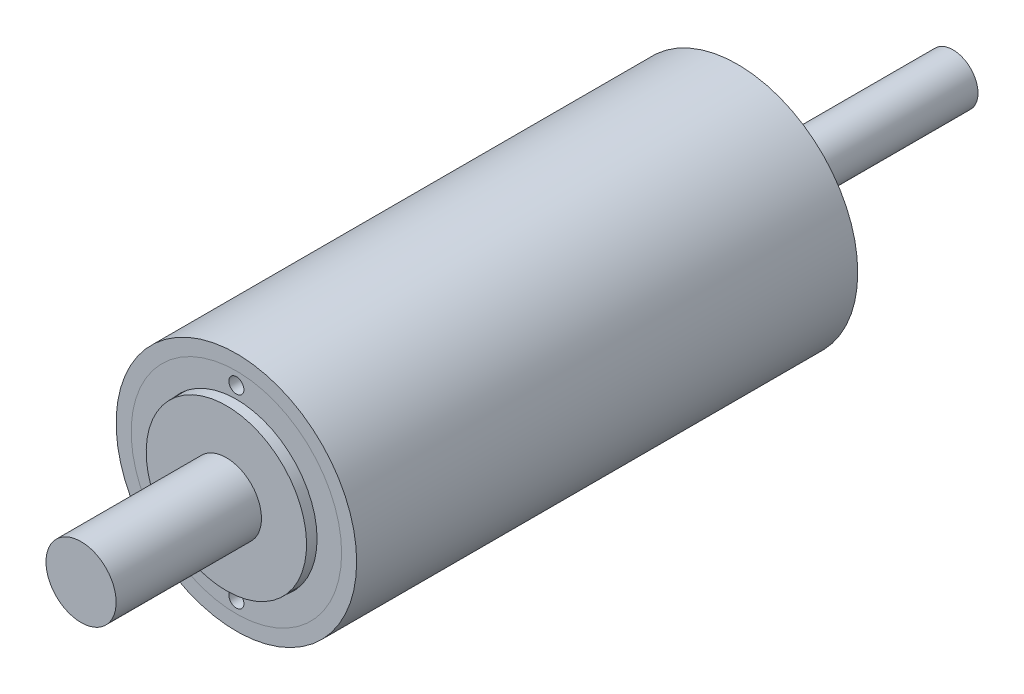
from build123d import *

# Parameters (mm, degrees)
SKETCH5_R            = 20
SKETCH5_R_2          = 8.5
BOSS_EXTRUDE1_DEPTH  = 12
SKETCH6_R            = 20
SKETCH6_R_2          = 8.5
BOSS_EXTRUDE2_DEPTH  = 12
SKETCH7_R            = 11.5
SKETCH7_R_2          = 8.5
BOSS_EXTRUDE3_DEPTH  = 2
BOSS_EXTRUDE4_START  = 8
SKETCH8_R            = 17.5
SKETCH8_R_2          = 8.5
BOSS_EXTRUDE4_DEPTH  = 8
SKETCH9_R            = 16
SKETCH9_R_2          = 6
BOSS_EXTRUDE5_DEPTH  = 10
SKETCH11_R           = 15.5
SKETCH11_R_2         = 14
BOSS_EXTRUDE8_DEPTH  = 10
SKETCH12_R           = 16
SKETCH12_R_2         = 6
BOSS_EXTRUDE9_DEPTH  = 10
SKETCH13_R           = 9
SKETCH13_R_2         = 6
BOSS_EXTRUDE10_DEPTH = 2
BOSS_EXTRUDE11_START = 8
SKETCH14_R           = 13
SKETCH14_R_2         = 6
BOSS_EXTRUDE11_DEPTH = 8
SKETCH15_R           = 24
BOSS_EXTRUDE12_DEPTH = 50
SKETCH16_R           = 16
CUT_EXTRUDE1_DEPTH   = 100
SKETCH17_R           = 21
SKETCH17_R_2         = 16
CUT_EXTRUDE2_DEPTH   = 11
CUT_EXTRUDE3_START   = -34
SKETCH18_R           = 20
SKETCH18_R_2         = 16
CUT_EXTRUDE3_DEPTH   = 34
CUT_EXTRUDE4_START   = -14
SKETCH19_R           = 18
SKETCH19_R_2         = 16
CUT_EXTRUDE4_DEPTH   = 14
SKETCH20_R           = 21
SKETCH20_R_2         = 20
CUT_EXTRUDE5_DEPTH   = 10
SKETCH21_R           = 21
SKETCH21_R_2         = 16.1
BOSS_EXTRUDE13_DEPTH = 10
SKETCH22_R           = 1.5
CUT_EXTRUDE6_DEPTH   = 5
SKETCH23_R           = 21
SKETCH23_R_2         = 13.5
BOSS_EXTRUDE14_DEPTH = 10
SKETCH24_R           = 1.5
CUT_EXTRUDE7_DEPTH   = 5


with BuildPart() as part:
    # Sketch1 → Revolve2 (revolve)
    with BuildSketch(Plane(origin=(0, 0, 0), x_dir=(0, 0, -1), z_dir=(1, 0, 0)), mode=Mode.PRIVATE) as revolve2_sk:
        Polygon((-81, 0), (-81, 7), (-52, 7), (-52, 16), (-48, 16), (-48, 7.4), (-44, 7.4), (-44, 11), (-40, 11), (-40, 8.5), (-16, 8.5), (-16, 7.5), (-14, 7.5), (-14, 8.45), (-1, 8.45), (-1, 7.4), (9, 7.4), (9, 6), (39, 6), (39, 5), (41, 5), (41, 5.95), (53, 5.95), (53, 5), (93, 5), (93, 0), align=None)
    revolve(revolve2_sk.sketch.rotate(Axis((0, 0, 126.394277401), (0, 0, -1)), 180), axis=Axis((0, 0, 126.394277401), (0, 0, -1)))


with BuildPart() as body_2:
    # Sketch5 → Boss-Extrude1 (new body)
    with BuildSketch(Plane(origin=(0, 0, 40), x_dir=(-1, 0, 0), z_dir=(0, 0, -1))):
        with Locations(Location((0, 0, 0), (0, 0, 90))):
            Circle(SKETCH5_R)
        with Locations(Location((0, 0, 0), (0, 0, 90))):
            Circle(SKETCH5_R_2, mode=Mode.SUBTRACT)
    extrude(amount=BOSS_EXTRUDE1_DEPTH)


with BuildPart() as body_3:
    # Sketch6 → Boss-Extrude2 (new body)
    with BuildSketch(Plane(origin=(0, 0, 28), x_dir=(-1, 0, 0), z_dir=(0, 0, -1))):
        with Locations(Location((0, 0, 0), (0, 0, 90))):
            Circle(SKETCH6_R)
        with Locations(Location((0, 0, 0), (0, 0, 90))):
            Circle(SKETCH6_R_2, mode=Mode.SUBTRACT)
    extrude(amount=BOSS_EXTRUDE2_DEPTH)


with BuildPart() as body_4:
    # Sketch7 → Boss-Extrude3 (new body)
    with BuildSketch(Plane(origin=(0, 0, 16), x_dir=(-1, 0, 0), z_dir=(0, 0, -1))):
        with Locations(Location((0, 0, 0), (0, 0, 90))):
            Circle(SKETCH7_R)
        with Locations(Location((0, 0, 0), (0, 0, 90))):
            Circle(SKETCH7_R_2, mode=Mode.SUBTRACT)
    extrude(amount=BOSS_EXTRUDE3_DEPTH)

    # Sketch8 → Boss-Extrude4 (add)
    with BuildSketch(Plane(origin=(0, 0, 14), x_dir=(-1, 0, 0), z_dir=(0, 0, -1)).offset(BOSS_EXTRUDE4_START)):
        with Locations(Location((0, 0, 0), (0, 0, 90))):
            Circle(SKETCH8_R)
        with Locations(Location((0, 0, 0), (0, 0, 90))):
            Circle(SKETCH8_R_2, mode=Mode.SUBTRACT)
    extrude(amount=-BOSS_EXTRUDE4_DEPTH)


with BuildPart() as body_5:
    # Sketch9 → Boss-Extrude5 (new body)
    with BuildSketch(Plane(origin=(0, 0, -9), x_dir=(-1, 0, 0), z_dir=(0, 0, -1))):
        with Locations(Location((0, 0, 0), (0, 0, 90))):
            Circle(SKETCH9_R)
        with Locations(Location((0, 0, 0), (0, 0, 90))):
            Circle(SKETCH9_R_2, mode=Mode.SUBTRACT)
    extrude(amount=BOSS_EXTRUDE5_DEPTH)


with BuildPart() as body_6:
    # Sketch11 → Boss-Extrude8 (new body)
    with BuildSketch(Plane(origin=(0, 0, -19), x_dir=(-1, 0, 0), z_dir=(0, 0, -1))):
        with Locations(Location((0, 0, 0), (0, 0, 90))):
            Circle(SKETCH11_R)
        with Locations(Location((0, 0, 0), (0, 0, 90))):
            Circle(SKETCH11_R_2, mode=Mode.SUBTRACT)
    extrude(amount=BOSS_EXTRUDE8_DEPTH)


with BuildPart() as body_7:
    # Sketch12 → Boss-Extrude9 (new body)
    with BuildSketch(Plane(origin=(0, 0, -29), x_dir=(-1, 0, 0), z_dir=(0, 0, -1))):
        with Locations(Location((0, 0, 0), (0, 0, 90))):
            Circle(SKETCH12_R)
        with Locations(Location((0, 0, 0), (0, 0, 90))):
            Circle(SKETCH12_R_2, mode=Mode.SUBTRACT)
    extrude(amount=BOSS_EXTRUDE9_DEPTH)


with BuildPart() as body_8:
    # Sketch13 → Boss-Extrude10 (new body)
    with BuildSketch(Plane(origin=(0, 0, -39), x_dir=(-1, 0, 0), z_dir=(0, 0, -1))):
        with Locations(Location((0, 0, 0), (0, 0, 90))):
            Circle(SKETCH13_R)
        with Locations(Location((0, 0, 0), (0, 0, 90))):
            Circle(SKETCH13_R_2, mode=Mode.SUBTRACT)
    extrude(amount=BOSS_EXTRUDE10_DEPTH)

    # Sketch14 → Boss-Extrude11 (add)
    with BuildSketch(Plane(origin=(0, 0, -41), x_dir=(-1, 0, 0), z_dir=(0, 0, -1)).offset(BOSS_EXTRUDE11_START)):
        with Locations(Location((0, 0, 0), (0, 0, 90))):
            Circle(SKETCH14_R)
        with Locations(Location((0, 0, 0), (0, 0, 90))):
            Circle(SKETCH14_R_2, mode=Mode.SUBTRACT)
    extrude(amount=-BOSS_EXTRUDE11_DEPTH)


with BuildPart() as body_9:
    # Sketch15 → Boss-Extrude12 (new, symmetric)
    with BuildSketch(Plane.XY):
        Circle(SKETCH15_R)
    extrude(amount=BOSS_EXTRUDE12_DEPTH, both=True)

    # Sketch16 → Cut-Extrude1 (cut)
    with BuildSketch(Plane(origin=(0, 0, -50), x_dir=(-1, 0, 0), z_dir=(0, 0, -1))):
        Circle(SKETCH16_R)
    extrude(amount=-CUT_EXTRUDE1_DEPTH, mode=Mode.SUBTRACT)

    # Sketch17 → Cut-Extrude2 (cut)
    with BuildSketch(Plane(origin=(0, 0, -50), x_dir=(-1, 0, 0), z_dir=(0, 0, -1))):
        Circle(SKETCH17_R)
        Circle(SKETCH17_R_2, mode=Mode.SUBTRACT)
    extrude(amount=-CUT_EXTRUDE2_DEPTH, mode=Mode.SUBTRACT)

    # Sketch18 → Cut-Extrude3 (cut)
    with BuildSketch(Plane.XY.offset(50).offset(CUT_EXTRUDE3_START)):
        Circle(SKETCH18_R)
        with Locations(Location((0, 0, 0), (0, 0, 180))):
            Circle(SKETCH18_R_2, mode=Mode.SUBTRACT)
    extrude(amount=CUT_EXTRUDE3_DEPTH, mode=Mode.SUBTRACT)

    # Sketch19 → Cut-Extrude4 (cut)
    with BuildSketch(Plane.XY.offset(16).offset(CUT_EXTRUDE4_START)):
        Circle(SKETCH19_R)
        with Locations(Location((0, 0, 0), (0, 0, 180))):
            Circle(SKETCH19_R_2, mode=Mode.SUBTRACT)
    extrude(amount=CUT_EXTRUDE4_DEPTH, mode=Mode.SUBTRACT)

    # Sketch20 → Cut-Extrude5 (cut)
    with BuildSketch(Plane.XY.offset(50)):
        with Locations(Location((0, 0, 0), (0, 0, 180))):
            Circle(SKETCH20_R)
        Circle(SKETCH20_R_2, mode=Mode.SUBTRACT)
    extrude(amount=-CUT_EXTRUDE5_DEPTH, mode=Mode.SUBTRACT)


with BuildPart() as body_10:
    # Sketch21 → Boss-Extrude13 (new body)
    with BuildSketch(Plane.XY.offset(50)):
        Circle(SKETCH21_R)
        Circle(SKETCH21_R_2, mode=Mode.SUBTRACT)
    extrude(amount=-BOSS_EXTRUDE13_DEPTH)

    # Sketch22 → Cut-Extrude6 (cut)
    with BuildSketch(Plane.XY.offset(50)):
        with Locations((0, -18.5)):
            Circle(SKETCH22_R)
        with Locations((0, 18.5)):
            Circle(SKETCH22_R)
    extrude(amount=-CUT_EXTRUDE6_DEPTH, mode=Mode.SUBTRACT)


with BuildPart() as body_11:
    # Sketch23 → Boss-Extrude14 (new body)
    with BuildSketch(Plane(origin=(0, 0, -50), x_dir=(-1, 0, 0), z_dir=(0, 0, -1))):
        Circle(SKETCH23_R)
        Circle(SKETCH23_R_2, mode=Mode.SUBTRACT)
    extrude(amount=-BOSS_EXTRUDE14_DEPTH)

    # Sketch24 → Cut-Extrude7 (cut)
    with BuildSketch(Plane(origin=(0, 0, -50), x_dir=(-1, 0, 0), z_dir=(0, 0, -1))):
        with Locations((0, -18.5)):
            Circle(SKETCH24_R)
        with Locations((0, 18.5)):
            Circle(SKETCH24_R)
    extrude(amount=-CUT_EXTRUDE7_DEPTH, mode=Mode.SUBTRACT)


solid = Compound([part.part, body_2.part, body_3.part, body_4.part, body_5.part, body_6.part, body_7.part, body_8.part, body_9.part, body_10.part, body_11.part])
